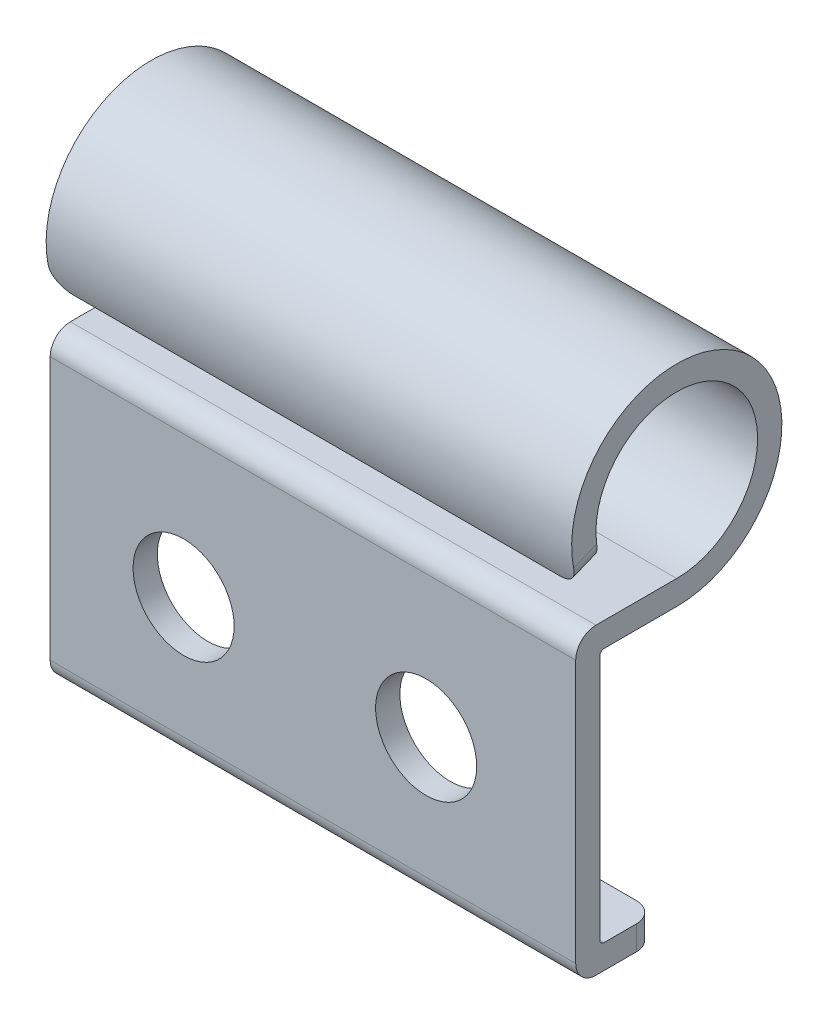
ISO-10303-21;
HEADER;
FILE_DESCRIPTION(('STEP AP214'),'2;1');
FILE_NAME('part.step','',(''),(''),'','','');
FILE_SCHEMA(('AUTOMOTIVE_DESIGN { 1 0 10303 214 1 1 1 1 }'));
ENDSEC;
DATA;
#1=APPLICATION_CONTEXT('core data for automotive mechanical design processes');
#2=APPLICATION_PROTOCOL_DEFINITION('international standard','automotive_design',2000,#1);
#3=PRODUCT_CONTEXT('',#1,'mechanical');
#4=PRODUCT('Part','Part','',(#3));
#5=PRODUCT_RELATED_PRODUCT_CATEGORY('part','',(#4));
#6=PRODUCT_DEFINITION_FORMATION('','',#4);
#7=PRODUCT_DEFINITION_CONTEXT('part definition',#1,'design');
#8=PRODUCT_DEFINITION('design','',#6,#7);
#9=PRODUCT_DEFINITION_SHAPE('','',#8);
#10=(LENGTH_UNIT() NAMED_UNIT(*) SI_UNIT(.MILLI.,.METRE.));
#11=(NAMED_UNIT(*) PLANE_ANGLE_UNIT() SI_UNIT($,.RADIAN.));
#12=(NAMED_UNIT(*) SI_UNIT($,.STERADIAN.) SOLID_ANGLE_UNIT());
#13=UNCERTAINTY_MEASURE_WITH_UNIT(LENGTH_MEASURE(1.E-05),#10,'distance_accuracy_value','');
#14=(GEOMETRIC_REPRESENTATION_CONTEXT(3) GLOBAL_UNCERTAINTY_ASSIGNED_CONTEXT((#13)) GLOBAL_UNIT_ASSIGNED_CONTEXT((#10,
#11,#12)) REPRESENTATION_CONTEXT('',''));
#15=CARTESIAN_POINT('',(0.,0.,0.));
#16=DIRECTION('',(0.,0.,1.));
#17=DIRECTION('',(1.,0.,0.));
#18=AXIS2_PLACEMENT_3D('',#15,#16,#17);
#19=CARTESIAN_POINT('',(13.,-9.,2.5));
#20=DIRECTION('',(0.,0.,1.));
#21=DIRECTION('',(1.,0.,0.));
#22=AXIS2_PLACEMENT_3D('',#19,#20,#21);
#23=PLANE('',#22);
#24=CARTESIAN_POINT('',(3.3,-6.,2.5));
#25=DIRECTION('',(0.,0.,-1.));
#26=DIRECTION('',(-1.,0.,0.));
#27=AXIS2_PLACEMENT_3D('',#24,#25,#26);
#28=CIRCLE('',#27,1.25);
#29=CARTESIAN_POINT('',(2.05,-6.,2.5));
#30=VERTEX_POINT('',#29);
#31=EDGE_CURVE('E209',#30,#30,#28,.T.);
#32=ORIENTED_EDGE('',*,*,#31,.T.);
#33=EDGE_LOOP('',(#32));
#34=FACE_BOUND('',#33,.T.);
#35=DIRECTION('',(0.,1.,0.));
#36=VECTOR('',#35,1.);
#37=CARTESIAN_POINT('',(0.,-9.,2.5));
#38=LINE('',#37,#36);
#39=CARTESIAN_POINT('',(0.,-9.,2.5));
#40=VERTEX_POINT('',#39);
#41=CARTESIAN_POINT('',(0.,-2.5,2.5));
#42=VERTEX_POINT('',#41);
#43=EDGE_CURVE('E216',#40,#42,#38,.T.);
#44=ORIENTED_EDGE('',*,*,#43,.F.);
#45=DIRECTION('',(-1.,0.,0.));
#46=VECTOR('',#45,1.);
#47=CARTESIAN_POINT('',(13.,-9.,2.5));
#48=LINE('',#47,#46);
#49=CARTESIAN_POINT('',(13.,-9.,2.5));
#50=VERTEX_POINT('',#49);
#51=EDGE_CURVE('E243',#50,#40,#48,.T.);
#52=ORIENTED_EDGE('',*,*,#51,.F.);
#53=DIRECTION('',(0.,1.,0.));
#54=VECTOR('',#53,1.);
#55=CARTESIAN_POINT('',(13.,-9.,2.5));
#56=LINE('',#55,#54);
#57=CARTESIAN_POINT('',(13.,-2.5,2.5));
#58=VERTEX_POINT('',#57);
#59=EDGE_CURVE('E187',#50,#58,#56,.T.);
#60=ORIENTED_EDGE('',*,*,#59,.T.);
#61=DIRECTION('',(-1.,0.,0.));
#62=VECTOR('',#61,1.);
#63=CARTESIAN_POINT('',(13.,-2.5,2.5));
#64=LINE('',#63,#62);
#65=EDGE_CURVE('E245',#58,#42,#64,.T.);
#66=ORIENTED_EDGE('',*,*,#65,.T.);
#67=EDGE_LOOP('',(#44,#52,#60,#66));
#68=FACE_BOUND('',#67,.T.);
#69=CARTESIAN_POINT('',(9.3,-6.,2.5));
#70=DIRECTION('',(0.,0.,-1.));
#71=DIRECTION('',(1.,0.,0.));
#72=AXIS2_PLACEMENT_3D('',#69,#70,#71);
#73=CIRCLE('',#72,1.25);
#74=CARTESIAN_POINT('',(10.55,-6.,2.5));
#75=VERTEX_POINT('',#74);
#76=EDGE_CURVE('E379',#75,#75,#73,.T.);
#77=ORIENTED_EDGE('',*,*,#76,.T.);
#78=EDGE_LOOP('',(#77));
#79=FACE_BOUND('',#78,.T.);
#80=ADVANCED_FACE('F34',(#34,#68,#79),#23,.T.);
#81=CARTESIAN_POINT('',(13.,-9.,1.9));
#82=DIRECTION('',(0.,0.,1.));
#83=DIRECTION('',(1.,0.,0.));
#84=AXIS2_PLACEMENT_3D('',#81,#82,#83);
#85=PLANE('',#84);
#86=CARTESIAN_POINT('',(3.3,-6.,1.9));
#87=DIRECTION('',(0.,0.,1.));
#88=DIRECTION('',(1.,0.,0.));
#89=AXIS2_PLACEMENT_3D('',#86,#87,#88);
#90=CIRCLE('',#89,1.25);
#91=CARTESIAN_POINT('',(4.55,-6.,1.9));
#92=VERTEX_POINT('',#91);
#93=EDGE_CURVE('E385',#92,#92,#90,.T.);
#94=ORIENTED_EDGE('',*,*,#93,.T.);
#95=EDGE_LOOP('',(#94));
#96=FACE_BOUND('',#95,.T.);
#97=DIRECTION('',(0.,1.,0.));
#98=VECTOR('',#97,1.);
#99=CARTESIAN_POINT('',(13.,-9.,1.9));
#100=LINE('',#99,#98);
#101=CARTESIAN_POINT('',(13.,-8.8,1.9));
#102=VERTEX_POINT('',#101);
#103=CARTESIAN_POINT('',(13.,-2.7,1.9));
#104=VERTEX_POINT('',#103);
#105=EDGE_CURVE('E201',#102,#104,#100,.T.);
#106=ORIENTED_EDGE('',*,*,#105,.F.);
#107=DIRECTION('',(-1.,0.,0.));
#108=VECTOR('',#107,1.);
#109=CARTESIAN_POINT('',(0.,-8.8,1.9));
#110=LINE('',#109,#108);
#111=CARTESIAN_POINT('',(0.,-8.8,1.9));
#112=VERTEX_POINT('',#111);
#113=EDGE_CURVE('E440',#102,#112,#110,.T.);
#114=ORIENTED_EDGE('',*,*,#113,.T.);
#115=DIRECTION('',(0.,1.,0.));
#116=VECTOR('',#115,1.);
#117=CARTESIAN_POINT('',(0.,-9.,1.9));
#118=LINE('',#117,#116);
#119=CARTESIAN_POINT('',(0.,-2.7,1.9));
#120=VERTEX_POINT('',#119);
#121=EDGE_CURVE('E227',#112,#120,#118,.T.);
#122=ORIENTED_EDGE('',*,*,#121,.T.);
#123=DIRECTION('',(-1.,0.,0.));
#124=VECTOR('',#123,1.);
#125=CARTESIAN_POINT('',(13.,-2.7,1.9));
#126=LINE('',#125,#124);
#127=EDGE_CURVE('E319',#120,#104,#126,.F.);
#128=ORIENTED_EDGE('',*,*,#127,.T.);
#129=EDGE_LOOP('',(#106,#114,#122,#128));
#130=FACE_BOUND('',#129,.T.);
#131=CARTESIAN_POINT('',(9.3,-6.,1.9));
#132=DIRECTION('',(0.,0.,1.));
#133=DIRECTION('',(1.,0.,0.));
#134=AXIS2_PLACEMENT_3D('',#131,#132,#133);
#135=CIRCLE('',#134,1.25);
#136=CARTESIAN_POINT('',(10.55,-6.,1.9));
#137=VERTEX_POINT('',#136);
#138=EDGE_CURVE('E382',#137,#137,#135,.T.);
#139=ORIENTED_EDGE('',*,*,#138,.T.);
#140=EDGE_LOOP('',(#139));
#141=FACE_BOUND('',#140,.T.);
#142=ADVANCED_FACE('F295',(#96,#130,#141),#85,.F.);
#143=CARTESIAN_POINT('',(13.,0.,0.));
#144=DIRECTION('',(-1.,0.,0.));
#145=DIRECTION('',(0.,0.,1.));
#146=AXIS2_PLACEMENT_3D('',#143,#144,#145);
#147=CYLINDRICAL_SURFACE('',#146,2.6);
#148=CARTESIAN_POINT('',(0.,0.,0.));
#149=DIRECTION('',(1.,0.,0.));
#150=DIRECTION('',(0.,0.,-1.));
#151=AXIS2_PLACEMENT_3D('',#148,#149,#150);
#152=CIRCLE('',#151,2.6);
#153=CARTESIAN_POINT('',(0.,-2.6,0.));
#154=VERTEX_POINT('',#153);
#155=CARTESIAN_POINT('',(0.,-0.504490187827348,2.55058613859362));
#156=VERTEX_POINT('',#155);
#157=EDGE_CURVE('E206',#154,#156,#152,.T.);
#158=ORIENTED_EDGE('',*,*,#157,.T.);
#159=CARTESIAN_POINT('',(0.,-0.504490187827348,2.55058613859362));
#160=CARTESIAN_POINT('',(-2.70065870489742E-05,-0.532036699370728,2.54515536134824));
#161=CARTESIAN_POINT('',(0.0022759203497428,-0.559491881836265,2.53924406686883));
#162=CARTESIAN_POINT('',(0.0114419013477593,-0.613454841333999,2.52674014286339));
#163=CARTESIAN_POINT('',(0.0183026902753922,-0.639963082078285,2.5201478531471));
#164=CARTESIAN_POINT('',(0.0364944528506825,-0.691323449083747,2.50654849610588));
#165=CARTESIAN_POINT('',(0.0478301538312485,-0.716173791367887,2.49954099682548));
#166=CARTESIAN_POINT('',(0.0746701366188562,-0.763488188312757,2.48549665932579));
#167=CARTESIAN_POINT('',(0.0901728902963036,-0.785953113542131,2.47845983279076));
#168=CARTESIAN_POINT('',(0.124751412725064,-0.827706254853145,2.4648288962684));
#169=CARTESIAN_POINT('',(0.143791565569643,-0.847022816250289,2.45823119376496));
#170=CARTESIAN_POINT('',(0.18501161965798,-0.882265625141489,2.44580403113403));
#171=CARTESIAN_POINT('',(0.2071923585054,-0.898190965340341,2.43997477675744));
#172=CARTESIAN_POINT('',(0.254161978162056,-0.926331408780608,2.42943156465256));
#173=CARTESIAN_POINT('',(0.278961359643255,-0.938530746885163,2.42472236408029));
#174=CARTESIAN_POINT('',(0.330390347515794,-0.958851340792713,2.41675894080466));
#175=CARTESIAN_POINT('',(0.357019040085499,-0.966974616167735,2.41350399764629));
#176=CARTESIAN_POINT('',(0.40314297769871,-0.977161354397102,2.40939335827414));
#177=CARTESIAN_POINT('',(0.422368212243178,-0.98031344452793,2.40811016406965));
#178=CARTESIAN_POINT('',(0.461059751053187,-0.98451801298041,2.40639265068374));
#179=CARTESIAN_POINT('',(0.480525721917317,-0.985573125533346,2.40595726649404));
#180=CARTESIAN_POINT('',(0.5,-0.985571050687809,2.40596128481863));
#181=B_SPLINE_CURVE_WITH_KNOTS('',3,(#159,#160,#161,#162,#163,#164,#165,#166,#167,#168,#169,
#170,#171,#172,#173,#174,#175,#176,#177,#178,#179,#180),.UNSPECIFIED.,.F.,.F.,(4,2,2,2,2,2,2,2,
2,2,4),(0.,0.0841368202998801,0.168231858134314,0.252415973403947,0.336569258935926,
0.419917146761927,0.50328730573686,0.587005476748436,0.670682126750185,0.729128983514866,
0.787502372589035),.UNSPECIFIED.);
#182=CARTESIAN_POINT('',(0.500000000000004,-0.985571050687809,2.40596128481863));
#183=VERTEX_POINT('',#182);
#184=EDGE_CURVE('E281',#156,#183,#181,.T.);
#185=ORIENTED_EDGE('',*,*,#184,.T.);
#186=DIRECTION('',(-1.,0.,0.));
#187=VECTOR('',#186,1.);
#188=CARTESIAN_POINT('',(13.,-0.985571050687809,2.40596128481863));
#189=LINE('',#188,#187);
#190=CARTESIAN_POINT('',(12.5,-0.985571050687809,2.40596128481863));
#191=VERTEX_POINT('',#190);
#192=EDGE_CURVE('E249',#191,#183,#189,.T.);
#193=ORIENTED_EDGE('',*,*,#192,.F.);
#194=CARTESIAN_POINT('',(12.5,-0.985571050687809,2.40596128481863));
#195=CARTESIAN_POINT('',(12.5281188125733,-0.985588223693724,2.4059402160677));
#196=CARTESIAN_POINT('',(12.5562305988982,-0.983377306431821,2.40685968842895));
#197=CARTESIAN_POINT('',(12.6116397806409,-0.974625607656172,2.41042425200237));
#198=CARTESIAN_POINT('',(12.6389377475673,-0.968087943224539,2.41306810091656));
#199=CARTESIAN_POINT('',(12.6919749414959,-0.950804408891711,2.4199280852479));
#200=CARTESIAN_POINT('',(12.7177133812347,-0.940056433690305,2.42414500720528));
#201=CARTESIAN_POINT('',(12.7668811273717,-0.914600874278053,2.43386346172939));
#202=CARTESIAN_POINT('',(12.7903108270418,-0.899893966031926,2.43936477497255));
#203=CARTESIAN_POINT('',(12.834161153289,-0.866887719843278,2.4512877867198));
#204=CARTESIAN_POINT('',(12.8545863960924,-0.84859399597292,2.4577080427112));
#205=CARTESIAN_POINT('',(12.891887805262,-0.808848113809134,2.47107331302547));
#206=CARTESIAN_POINT('',(12.9087638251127,-0.787395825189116,2.4780183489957));
#207=CARTESIAN_POINT('',(12.9383951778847,-0.742040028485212,2.49197420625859));
#208=CARTESIAN_POINT('',(12.9511757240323,-0.71815276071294,2.49898434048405));
#209=CARTESIAN_POINT('',(12.9724234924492,-0.668460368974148,2.51273233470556));
#210=CARTESIAN_POINT('',(12.9808921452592,-0.642655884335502,2.51947028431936));
#211=CARTESIAN_POINT('',(12.9914119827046,-0.59802712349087,2.53035897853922));
#212=CARTESIAN_POINT('',(12.9946373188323,-0.57950790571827,2.53466615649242));
#213=CARTESIAN_POINT('',(12.9989314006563,-0.54217155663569,2.54291546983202));
#214=CARTESIAN_POINT('',(13.0000035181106,-0.523354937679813,2.54685816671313));
#215=CARTESIAN_POINT('',(13.,-0.504490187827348,2.55058613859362));
#216=B_SPLINE_CURVE_WITH_KNOTS('',3,(#194,#195,#196,#197,#198,#199,#200,#201,#202,#203,#204,
#205,#206,#207,#208,#209,#210,#211,#212,#213,#214,#215),.UNSPECIFIED.,.F.,.F.,(4,2,2,2,2,2,2,2,
2,2,4),(0.,0.0842446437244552,0.168428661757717,0.252654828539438,0.336866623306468,
0.420947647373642,0.505032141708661,0.588588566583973,0.672117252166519,0.729853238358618,
0.787498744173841),.UNSPECIFIED.);
#217=CARTESIAN_POINT('',(13.,-0.504490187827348,2.55058613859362));
#218=VERTEX_POINT('',#217);
#219=EDGE_CURVE('E274',#191,#218,#216,.T.);
#220=ORIENTED_EDGE('',*,*,#219,.T.);
#221=CARTESIAN_POINT('',(13.,0.,0.));
#222=DIRECTION('',(1.,0.,0.));
#223=DIRECTION('',(0.,0.,-1.));
#224=AXIS2_PLACEMENT_3D('',#221,#222,#223);
#225=CIRCLE('',#224,2.6);
#226=CARTESIAN_POINT('',(13.,-2.6,0.));
#227=VERTEX_POINT('',#226);
#228=EDGE_CURVE('E182',#227,#218,#225,.T.);
#229=ORIENTED_EDGE('',*,*,#228,.F.);
#230=DIRECTION('',(-1.,0.,0.));
#231=VECTOR('',#230,1.);
#232=CARTESIAN_POINT('',(13.,-2.6,0.));
#233=LINE('',#232,#231);
#234=EDGE_CURVE('E205',#227,#154,#233,.T.);
#235=ORIENTED_EDGE('',*,*,#234,.T.);
#236=EDGE_LOOP('',(#158,#185,#193,#220,#229,#235));
#237=FACE_BOUND('',#236,.T.);
#238=ADVANCED_FACE('F289',(#237),#147,.T.);
#239=CARTESIAN_POINT('',(13.,-0.758131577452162,1.85073944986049));
#240=DIRECTION('',(0.,-0.925369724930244,-0.379065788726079));
#241=DIRECTION('',(0.,0.379065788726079,-0.925369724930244));
#242=AXIS2_PLACEMENT_3D('',#239,#240,#241);
#243=PLANE('',#242);
#244=ORIENTED_EDGE('',*,*,#192,.T.);
#245=DIRECTION('',(0.,-0.379065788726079,0.925369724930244));
#246=VECTOR('',#245,1.);
#247=CARTESIAN_POINT('',(0.5,-0.758131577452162,1.85073944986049));
#248=LINE('',#247,#246);
#249=CARTESIAN_POINT('',(0.500000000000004,-0.758131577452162,1.85073944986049));
#250=VERTEX_POINT('',#249);
#251=EDGE_CURVE('E398',#183,#250,#248,.F.);
#252=ORIENTED_EDGE('',*,*,#251,.T.);
#253=DIRECTION('',(-1.,0.,0.));
#254=VECTOR('',#253,1.);
#255=CARTESIAN_POINT('',(13.,-0.758131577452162,1.85073944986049));
#256=LINE('',#255,#254);
#257=CARTESIAN_POINT('',(12.5,-0.758131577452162,1.85073944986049));
#258=VERTEX_POINT('',#257);
#259=EDGE_CURVE('E170',#258,#250,#256,.T.);
#260=ORIENTED_EDGE('',*,*,#259,.F.);
#261=DIRECTION('',(0.,-0.379065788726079,0.925369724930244));
#262=VECTOR('',#261,1.);
#263=CARTESIAN_POINT('',(12.5,-0.758131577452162,1.85073944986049));
#264=LINE('',#263,#262);
#265=EDGE_CURVE('E396',#258,#191,#264,.T.);
#266=ORIENTED_EDGE('',*,*,#265,.T.);
#267=EDGE_LOOP('',(#244,#252,#260,#266));
#268=FACE_BOUND('',#267,.T.);
#269=ADVANCED_FACE('F294',(#268),#243,.T.);
#270=CARTESIAN_POINT('',(13.,0.,0.));
#271=DIRECTION('',(-1.,0.,0.));
#272=DIRECTION('',(0.,0.,1.));
#273=AXIS2_PLACEMENT_3D('',#270,#271,#272);
#274=CYLINDRICAL_SURFACE('',#273,2.);
#275=ORIENTED_EDGE('',*,*,#259,.T.);
#276=CARTESIAN_POINT('',(0.5,-0.758131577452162,1.85073944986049));
#277=CARTESIAN_POINT('',(0.47188832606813,-0.758147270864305,1.85071479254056));
#278=CARTESIAN_POINT('',(0.443783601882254,-0.755938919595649,1.85163733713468));
#279=CARTESIAN_POINT('',(0.388386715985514,-0.747189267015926,1.85519495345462));
#280=CARTESIAN_POINT('',(0.361094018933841,-0.740650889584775,1.85782886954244));
#281=CARTESIAN_POINT('',(0.30806617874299,-0.723351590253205,1.86462955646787));
#282=CARTESIAN_POINT('',(0.282331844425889,-0.712588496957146,1.86879711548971));
#283=CARTESIAN_POINT('',(0.233172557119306,-0.687069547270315,1.87832943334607));
#284=CARTESIAN_POINT('',(0.209747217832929,-0.672314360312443,1.88369399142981));
#285=CARTESIAN_POINT('',(0.165932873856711,-0.63917826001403,1.89519302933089));
#286=CARTESIAN_POINT('',(0.145536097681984,-0.620806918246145,1.9013254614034));
#287=CARTESIAN_POINT('',(0.108293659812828,-0.580853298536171,1.91390883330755));
#288=CARTESIAN_POINT('',(0.0914477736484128,-0.559271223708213,1.92035975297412));
#289=CARTESIAN_POINT('',(0.0619384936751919,-0.513706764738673,1.93304371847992));
#290=CARTESIAN_POINT('',(0.0492324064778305,-0.489752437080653,1.93927835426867));
#291=CARTESIAN_POINT('',(0.0280730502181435,-0.439903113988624,1.95118955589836));
#292=CARTESIAN_POINT('',(0.019619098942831,-0.414008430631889,1.95686621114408));
#293=CARTESIAN_POINT('',(0.00889463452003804,-0.368580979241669,1.96583855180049));
#294=CARTESIAN_POINT('',(0.00554886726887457,-0.34933619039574,1.96935194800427));
#295=CARTESIAN_POINT('',(0.00110116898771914,-0.310532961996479,1.9758442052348));
#296=CARTESIAN_POINT('',(-4.48377917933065E-06,-0.290975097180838,1.97882394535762));
#297=CARTESIAN_POINT('',(0.,-0.271372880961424,1.98150366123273));
#298=B_SPLINE_CURVE_WITH_KNOTS('',3,(#276,#277,#278,#279,#280,#281,#282,#283,#284,#285,#286,
#287,#288,#289,#290,#291,#292,#293,#294,#295,#296,#297),.UNSPECIFIED.,.F.,.F.,(4,2,2,2,2,2,2,2,
2,2,4),(0.,0.0842234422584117,0.168390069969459,0.252600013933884,0.336795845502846,
0.420771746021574,0.504742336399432,0.5878173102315,0.670878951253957,0.730289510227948,
0.78960128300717),.UNSPECIFIED.);
#299=CARTESIAN_POINT('',(0.,-0.271372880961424,1.98150366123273));
#300=VERTEX_POINT('',#299);
#301=EDGE_CURVE('E313',#250,#300,#298,.T.);
#302=ORIENTED_EDGE('',*,*,#301,.T.);
#303=CARTESIAN_POINT('',(0.,0.,0.));
#304=DIRECTION('',(1.,0.,0.));
#305=DIRECTION('',(0.,0.,-1.));
#306=AXIS2_PLACEMENT_3D('',#303,#304,#305);
#307=CIRCLE('',#306,2.);
#308=CARTESIAN_POINT('',(0.,-2.,0.));
#309=VERTEX_POINT('',#308);
#310=EDGE_CURVE('E165',#309,#300,#307,.T.);
#311=ORIENTED_EDGE('',*,*,#310,.F.);
#312=DIRECTION('',(-1.,0.,0.));
#313=VECTOR('',#312,1.);
#314=CARTESIAN_POINT('',(13.,-2.,0.));
#315=LINE('',#314,#313);
#316=CARTESIAN_POINT('',(13.,-2.,0.));
#317=VERTEX_POINT('',#316);
#318=EDGE_CURVE('E158',#317,#309,#315,.T.);
#319=ORIENTED_EDGE('',*,*,#318,.F.);
#320=CARTESIAN_POINT('',(13.,0.,0.));
#321=DIRECTION('',(1.,0.,0.));
#322=DIRECTION('',(0.,0.,-1.));
#323=AXIS2_PLACEMENT_3D('',#320,#321,#322);
#324=CIRCLE('',#323,2.);
#325=CARTESIAN_POINT('',(13.,-0.271372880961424,1.98150366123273));
#326=VERTEX_POINT('',#325);
#327=EDGE_CURVE('E162',#317,#326,#324,.T.);
#328=ORIENTED_EDGE('',*,*,#327,.T.);
#329=CARTESIAN_POINT('',(13.,-0.271372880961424,1.98150366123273));
#330=CARTESIAN_POINT('',(13.0000288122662,-0.299157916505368,1.97772108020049));
#331=CARTESIAN_POINT('',(12.997790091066,-0.326867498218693,1.97330895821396));
#332=CARTESIAN_POINT('',(12.9888252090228,-0.381360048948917,1.96349352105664));
#333=CARTESIAN_POINT('',(12.9821003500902,-0.408143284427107,1.95809049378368));
#334=CARTESIAN_POINT('',(12.9641978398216,-0.460061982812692,1.94655028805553));
#335=CARTESIAN_POINT('',(12.9530137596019,-0.485195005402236,1.94041205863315));
#336=CARTESIAN_POINT('',(12.9264679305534,-0.533042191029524,1.92781660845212));
#337=CARTESIAN_POINT('',(12.9111082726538,-0.555757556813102,1.92135954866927));
#338=CARTESIAN_POINT('',(12.8769061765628,-0.597830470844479,1.90868415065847));
#339=CARTESIAN_POINT('',(12.8581234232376,-0.617235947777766,1.90246364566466));
#340=CARTESIAN_POINT('',(12.8174344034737,-0.652665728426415,1.89060236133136));
#341=CARTESIAN_POINT('',(12.7955271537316,-0.668688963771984,1.88496176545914));
#342=CARTESIAN_POINT('',(12.7490535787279,-0.697086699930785,1.87464683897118));
#343=CARTESIAN_POINT('',(12.7244706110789,-0.709436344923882,1.86997915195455));
#344=CARTESIAN_POINT('',(12.6734564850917,-0.730083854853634,1.86201516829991));
#345=CARTESIAN_POINT('',(12.6470261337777,-0.738383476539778,1.85871827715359));
#346=CARTESIAN_POINT('',(12.600421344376,-0.749083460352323,1.85442661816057));
#347=CARTESIAN_POINT('',(12.5805026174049,-0.752474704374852,1.8530494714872));
#348=CARTESIAN_POINT('',(12.5403917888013,-0.756998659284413,1.85120351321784));
#349=CARTESIAN_POINT('',(12.5202000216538,-0.758133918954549,1.85073367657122));
#350=CARTESIAN_POINT('',(12.5,-0.758131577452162,1.85073944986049));
#351=B_SPLINE_CURVE_WITH_KNOTS('',3,(#329,#330,#331,#332,#333,#334,#335,#336,#337,#338,#339,
#340,#341,#342,#343,#344,#345,#346,#347,#348,#349,#350),.UNSPECIFIED.,.F.,.F.,(4,2,2,2,2,2,2,2,
2,2,4),(0.,0.0840428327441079,0.168061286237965,0.252201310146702,0.33629927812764,
0.419051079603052,0.50182898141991,0.585154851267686,0.668444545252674,0.72906001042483,
0.789606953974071),.UNSPECIFIED.);
#352=EDGE_CURVE('E320',#326,#258,#351,.T.);
#353=ORIENTED_EDGE('',*,*,#352,.T.);
#354=EDGE_LOOP('',(#275,#302,#311,#319,#328,#353));
#355=FACE_BOUND('',#354,.T.);
#356=ADVANCED_FACE('F161',(#355),#274,.F.);
#357=CARTESIAN_POINT('',(13.,-2.,2.));
#358=DIRECTION('',(0.,1.,0.));
#359=DIRECTION('',(0.,0.,1.));
#360=AXIS2_PLACEMENT_3D('',#357,#358,#359);
#361=PLANE('',#360);
#362=DIRECTION('',(0.,0.,-1.));
#363=VECTOR('',#362,1.);
#364=CARTESIAN_POINT('',(0.,-2.,2.));
#365=LINE('',#364,#363);
#366=CARTESIAN_POINT('',(0.,-2.,2.));
#367=VERTEX_POINT('',#366);
#368=EDGE_CURVE('E211',#367,#309,#365,.T.);
#369=ORIENTED_EDGE('',*,*,#368,.F.);
#370=DIRECTION('',(-1.,0.,0.));
#371=VECTOR('',#370,1.);
#372=CARTESIAN_POINT('',(13.,-2.,2.));
#373=LINE('',#372,#371);
#374=CARTESIAN_POINT('',(13.,-2.,2.));
#375=VERTEX_POINT('',#374);
#376=EDGE_CURVE('E171',#375,#367,#373,.T.);
#377=ORIENTED_EDGE('',*,*,#376,.F.);
#378=DIRECTION('',(0.,0.,-1.));
#379=VECTOR('',#378,1.);
#380=CARTESIAN_POINT('',(13.,-2.,2.));
#381=LINE('',#380,#379);
#382=EDGE_CURVE('E177',#375,#317,#381,.T.);
#383=ORIENTED_EDGE('',*,*,#382,.T.);
#384=ORIENTED_EDGE('',*,*,#318,.T.);
#385=EDGE_LOOP('',(#369,#377,#383,#384));
#386=FACE_BOUND('',#385,.T.);
#387=ADVANCED_FACE('F184',(#386),#361,.T.);
#388=CARTESIAN_POINT('',(13.,-2.5,2.));
#389=DIRECTION('',(-1.,0.,0.));
#390=DIRECTION('',(0.,0.,1.));
#391=AXIS2_PLACEMENT_3D('',#388,#389,#390);
#392=CYLINDRICAL_SURFACE('',#391,0.5);
#393=CARTESIAN_POINT('',(0.,-2.5,2.));
#394=DIRECTION('',(-1.,0.,0.));
#395=DIRECTION('',(0.,0.,1.));
#396=AXIS2_PLACEMENT_3D('',#393,#394,#395);
#397=CIRCLE('',#396,0.5);
#398=EDGE_CURVE('E213',#42,#367,#397,.T.);
#399=ORIENTED_EDGE('',*,*,#398,.F.);
#400=ORIENTED_EDGE('',*,*,#65,.F.);
#401=CARTESIAN_POINT('',(13.,-2.5,2.));
#402=DIRECTION('',(-1.,0.,0.));
#403=DIRECTION('',(0.,0.,1.));
#404=AXIS2_PLACEMENT_3D('',#401,#402,#403);
#405=CIRCLE('',#404,0.5);
#406=EDGE_CURVE('E185',#58,#375,#405,.T.);
#407=ORIENTED_EDGE('',*,*,#406,.T.);
#408=ORIENTED_EDGE('',*,*,#376,.T.);
#409=EDGE_LOOP('',(#399,#400,#407,#408));
#410=FACE_BOUND('',#409,.T.);
#411=ADVANCED_FACE('F332',(#410),#392,.T.);
#412=CARTESIAN_POINT('',(13.,-9.,2.));
#413=DIRECTION('',(-1.,0.,0.));
#414=DIRECTION('',(0.,0.,1.));
#415=AXIS2_PLACEMENT_3D('',#412,#413,#414);
#416=CYLINDRICAL_SURFACE('',#415,0.500000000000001);
#417=CARTESIAN_POINT('',(0.,-9.,2.));
#418=DIRECTION('',(-1.,0.,0.));
#419=DIRECTION('',(0.,0.,1.));
#420=AXIS2_PLACEMENT_3D('',#417,#418,#419);
#421=CIRCLE('',#420,0.500000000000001);
#422=CARTESIAN_POINT('',(0.,-9.5,2.));
#423=VERTEX_POINT('',#422);
#424=EDGE_CURVE('E219',#423,#40,#421,.T.);
#425=ORIENTED_EDGE('',*,*,#424,.F.);
#426=DIRECTION('',(-1.,0.,0.));
#427=VECTOR('',#426,1.);
#428=CARTESIAN_POINT('',(13.,-9.5,2.));
#429=LINE('',#428,#427);
#430=CARTESIAN_POINT('',(13.,-9.5,2.));
#431=VERTEX_POINT('',#430);
#432=EDGE_CURVE('E240',#431,#423,#429,.T.);
#433=ORIENTED_EDGE('',*,*,#432,.F.);
#434=CARTESIAN_POINT('',(13.,-9.,2.));
#435=DIRECTION('',(-1.,0.,0.));
#436=DIRECTION('',(0.,0.,1.));
#437=AXIS2_PLACEMENT_3D('',#434,#435,#436);
#438=CIRCLE('',#437,0.500000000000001);
#439=EDGE_CURVE('E193',#431,#50,#438,.T.);
#440=ORIENTED_EDGE('',*,*,#439,.T.);
#441=ORIENTED_EDGE('',*,*,#51,.T.);
#442=EDGE_LOOP('',(#425,#433,#440,#441));
#443=FACE_BOUND('',#442,.T.);
#444=ADVANCED_FACE('F335',(#443),#416,.T.);
#445=CARTESIAN_POINT('',(13.,-9.5,0.5));
#446=DIRECTION('',(0.,-1.,0.));
#447=DIRECTION('',(0.,0.,-1.));
#448=AXIS2_PLACEMENT_3D('',#445,#446,#447);
#449=PLANE('',#448);
#450=DIRECTION('',(0.,0.,1.));
#451=VECTOR('',#450,1.);
#452=CARTESIAN_POINT('',(0.,-9.5,0.5));
#453=LINE('',#452,#451);
#454=CARTESIAN_POINT('',(0.,-9.5,1.));
#455=VERTEX_POINT('',#454);
#456=EDGE_CURVE('E222',#455,#423,#453,.T.);
#457=ORIENTED_EDGE('',*,*,#456,.F.);
#458=CARTESIAN_POINT('',(0.5,-9.5,1.));
#459=DIRECTION('',(0.,-1.,0.));
#460=DIRECTION('',(0.,0.,-1.));
#461=AXIS2_PLACEMENT_3D('',#458,#459,#460);
#462=CIRCLE('',#461,0.5);
#463=CARTESIAN_POINT('',(0.500000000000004,-9.5,0.5));
#464=VERTEX_POINT('',#463);
#465=EDGE_CURVE('E260',#455,#464,#462,.T.);
#466=ORIENTED_EDGE('',*,*,#465,.T.);
#467=DIRECTION('',(-1.,0.,0.));
#468=VECTOR('',#467,1.);
#469=CARTESIAN_POINT('',(13.,-9.5,0.5));
#470=LINE('',#469,#468);
#471=CARTESIAN_POINT('',(12.5,-9.5,0.5));
#472=VERTEX_POINT('',#471);
#473=EDGE_CURVE('E237',#472,#464,#470,.T.);
#474=ORIENTED_EDGE('',*,*,#473,.F.);
#475=CARTESIAN_POINT('',(12.5,-9.5,1.));
#476=DIRECTION('',(0.,-1.,0.));
#477=DIRECTION('',(0.,0.,-1.));
#478=AXIS2_PLACEMENT_3D('',#475,#476,#477);
#479=CIRCLE('',#478,0.5);
#480=CARTESIAN_POINT('',(13.,-9.5,1.));
#481=VERTEX_POINT('',#480);
#482=EDGE_CURVE('E258',#472,#481,#479,.T.);
#483=ORIENTED_EDGE('',*,*,#482,.T.);
#484=DIRECTION('',(0.,0.,1.));
#485=VECTOR('',#484,1.);
#486=CARTESIAN_POINT('',(13.,-9.5,0.5));
#487=LINE('',#486,#485);
#488=EDGE_CURVE('E196',#481,#431,#487,.T.);
#489=ORIENTED_EDGE('',*,*,#488,.T.);
#490=ORIENTED_EDGE('',*,*,#432,.T.);
#491=EDGE_LOOP('',(#457,#466,#474,#483,#489,#490));
#492=FACE_BOUND('',#491,.T.);
#493=ADVANCED_FACE('F342',(#492),#449,.T.);
#494=CARTESIAN_POINT('',(13.,-8.9,0.500000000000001));
#495=DIRECTION('',(0.,0.,-1.));
#496=DIRECTION('',(0.,1.,0.));
#497=AXIS2_PLACEMENT_3D('',#494,#495,#496);
#498=PLANE('',#497);
#499=ORIENTED_EDGE('',*,*,#473,.T.);
#500=DIRECTION('',(0.,-1.,0.));
#501=VECTOR('',#500,1.);
#502=CARTESIAN_POINT('',(0.5,-8.9,0.500000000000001));
#503=LINE('',#502,#501);
#504=CARTESIAN_POINT('',(0.500000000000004,-8.9,0.500000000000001));
#505=VERTEX_POINT('',#504);
#506=EDGE_CURVE('E265',#464,#505,#503,.F.);
#507=ORIENTED_EDGE('',*,*,#506,.T.);
#508=DIRECTION('',(-1.,0.,0.));
#509=VECTOR('',#508,1.);
#510=CARTESIAN_POINT('',(13.,-8.9,0.500000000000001));
#511=LINE('',#510,#509);
#512=CARTESIAN_POINT('',(12.5,-8.9,0.500000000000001));
#513=VERTEX_POINT('',#512);
#514=EDGE_CURVE('E234',#513,#505,#511,.T.);
#515=ORIENTED_EDGE('',*,*,#514,.F.);
#516=DIRECTION('',(0.,-1.,0.));
#517=VECTOR('',#516,1.);
#518=CARTESIAN_POINT('',(12.5,-8.9,0.500000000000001));
#519=LINE('',#518,#517);
#520=EDGE_CURVE('E262',#513,#472,#519,.T.);
#521=ORIENTED_EDGE('',*,*,#520,.T.);
#522=EDGE_LOOP('',(#499,#507,#515,#521));
#523=FACE_BOUND('',#522,.T.);
#524=ADVANCED_FACE('F346',(#523),#498,.T.);
#525=CARTESIAN_POINT('',(13.,-8.9,0.500000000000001));
#526=DIRECTION('',(0.,-1.,0.));
#527=DIRECTION('',(0.,0.,-1.));
#528=AXIS2_PLACEMENT_3D('',#525,#526,#527);
#529=PLANE('',#528);
#530=DIRECTION('',(0.,0.,1.));
#531=VECTOR('',#530,1.);
#532=CARTESIAN_POINT('',(0.,-8.9,0.500000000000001));
#533=LINE('',#532,#531);
#534=CARTESIAN_POINT('',(0.,-8.9,1.));
#535=VERTEX_POINT('',#534);
#536=CARTESIAN_POINT('',(0.,-8.9,1.8));
#537=VERTEX_POINT('',#536);
#538=EDGE_CURVE('E224',#535,#537,#533,.T.);
#539=ORIENTED_EDGE('',*,*,#538,.T.);
#540=DIRECTION('',(-1.,0.,0.));
#541=VECTOR('',#540,1.);
#542=CARTESIAN_POINT('',(13.,-8.9,1.8));
#543=LINE('',#542,#541);
#544=CARTESIAN_POINT('',(13.,-8.9,1.8));
#545=VERTEX_POINT('',#544);
#546=EDGE_CURVE('E434',#537,#545,#543,.F.);
#547=ORIENTED_EDGE('',*,*,#546,.T.);
#548=DIRECTION('',(0.,0.,1.));
#549=VECTOR('',#548,1.);
#550=CARTESIAN_POINT('',(13.,-8.9,0.500000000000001));
#551=LINE('',#550,#549);
#552=CARTESIAN_POINT('',(13.,-8.9,1.));
#553=VERTEX_POINT('',#552);
#554=EDGE_CURVE('E198',#553,#545,#551,.T.);
#555=ORIENTED_EDGE('',*,*,#554,.F.);
#556=CARTESIAN_POINT('',(12.5,-8.9,1.));
#557=DIRECTION('',(0.,-1.,0.));
#558=DIRECTION('',(0.,0.,-1.));
#559=AXIS2_PLACEMENT_3D('',#556,#557,#558);
#560=CIRCLE('',#559,0.5);
#561=EDGE_CURVE('E267',#553,#513,#560,.F.);
#562=ORIENTED_EDGE('',*,*,#561,.T.);
#563=ORIENTED_EDGE('',*,*,#514,.T.);
#564=CARTESIAN_POINT('',(0.5,-8.9,1.));
#565=DIRECTION('',(0.,-1.,0.));
#566=DIRECTION('',(0.,0.,-1.));
#567=AXIS2_PLACEMENT_3D('',#564,#565,#566);
#568=CIRCLE('',#567,0.5);
#569=EDGE_CURVE('E269',#505,#535,#568,.F.);
#570=ORIENTED_EDGE('',*,*,#569,.T.);
#571=EDGE_LOOP('',(#539,#547,#555,#562,#563,#570));
#572=FACE_BOUND('',#571,.T.);
#573=ADVANCED_FACE('F350',(#572),#529,.F.);
#574=CARTESIAN_POINT('',(13.,-2.6,2.));
#575=DIRECTION('',(0.,1.,0.));
#576=DIRECTION('',(0.,0.,1.));
#577=AXIS2_PLACEMENT_3D('',#574,#575,#576);
#578=PLANE('',#577);
#579=DIRECTION('',(0.,0.,-1.));
#580=VECTOR('',#579,1.);
#581=CARTESIAN_POINT('',(13.,-2.6,2.));
#582=LINE('',#581,#580);
#583=CARTESIAN_POINT('',(13.,-2.6,1.8));
#584=VERTEX_POINT('',#583);
#585=EDGE_CURVE('E203',#584,#227,#582,.T.);
#586=ORIENTED_EDGE('',*,*,#585,.F.);
#587=DIRECTION('',(-1.,0.,0.));
#588=VECTOR('',#587,1.);
#589=CARTESIAN_POINT('',(0.,-2.6,1.8));
#590=LINE('',#589,#588);
#591=CARTESIAN_POINT('',(0.,-2.6,1.8));
#592=VERTEX_POINT('',#591);
#593=EDGE_CURVE('E431',#584,#592,#590,.T.);
#594=ORIENTED_EDGE('',*,*,#593,.T.);
#595=DIRECTION('',(0.,0.,-1.));
#596=VECTOR('',#595,1.);
#597=CARTESIAN_POINT('',(0.,-2.6,2.));
#598=LINE('',#597,#596);
#599=EDGE_CURVE('E230',#592,#154,#598,.T.);
#600=ORIENTED_EDGE('',*,*,#599,.T.);
#601=ORIENTED_EDGE('',*,*,#234,.F.);
#602=EDGE_LOOP('',(#586,#594,#600,#601));
#603=FACE_BOUND('',#602,.T.);
#604=ADVANCED_FACE('F354',(#603),#578,.F.);
#605=CARTESIAN_POINT('',(13.,0.,0.));
#606=DIRECTION('',(1.,0.,0.));
#607=DIRECTION('',(0.,0.,-1.));
#608=AXIS2_PLACEMENT_3D('',#605,#606,#607);
#609=PLANE('',#608);
#610=ORIENTED_EDGE('',*,*,#488,.F.);
#611=DIRECTION('',(0.,-1.,0.));
#612=VECTOR('',#611,1.);
#613=CARTESIAN_POINT('',(13.,0.,1.00000000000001));
#614=LINE('',#613,#612);
#615=EDGE_CURVE('E272',#481,#553,#614,.F.);
#616=ORIENTED_EDGE('',*,*,#615,.T.);
#617=ORIENTED_EDGE('',*,*,#554,.T.);
#618=CARTESIAN_POINT('',(13.,-8.8,1.8));
#619=DIRECTION('',(1.,0.,0.));
#620=DIRECTION('',(0.,0.,-1.));
#621=AXIS2_PLACEMENT_3D('',#618,#619,#620);
#622=CIRCLE('',#621,0.1);
#623=EDGE_CURVE('E430',#545,#102,#622,.F.);
#624=ORIENTED_EDGE('',*,*,#623,.T.);
#625=ORIENTED_EDGE('',*,*,#105,.T.);
#626=CARTESIAN_POINT('',(13.,-2.7,1.8));
#627=DIRECTION('',(1.,0.,0.));
#628=DIRECTION('',(0.,0.,-1.));
#629=AXIS2_PLACEMENT_3D('',#626,#627,#628);
#630=CIRCLE('',#629,0.1);
#631=EDGE_CURVE('E11',#104,#584,#630,.F.);
#632=ORIENTED_EDGE('',*,*,#631,.T.);
#633=ORIENTED_EDGE('',*,*,#585,.T.);
#634=ORIENTED_EDGE('',*,*,#228,.T.);
#635=DIRECTION('',(0.,-0.379065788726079,0.925369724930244));
#636=VECTOR('',#635,1.);
#637=CARTESIAN_POINT('',(13.,0.462684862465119,0.189532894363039));
#638=LINE('',#637,#636);
#639=EDGE_CURVE('E181',#218,#326,#638,.F.);
#640=ORIENTED_EDGE('',*,*,#639,.T.);
#641=ORIENTED_EDGE('',*,*,#327,.F.);
#642=ORIENTED_EDGE('',*,*,#382,.F.);
#643=ORIENTED_EDGE('',*,*,#406,.F.);
#644=ORIENTED_EDGE('',*,*,#59,.F.);
#645=ORIENTED_EDGE('',*,*,#439,.F.);
#646=EDGE_LOOP('',(#610,#616,#617,#624,#625,#632,#633,#634,#640,#641,#642,#643,#644,#645));
#647=FACE_BOUND('',#646,.T.);
#648=ADVANCED_FACE('F175',(#647),#609,.T.);
#649=CARTESIAN_POINT('',(0.,0.,0.));
#650=DIRECTION('',(1.,0.,0.));
#651=DIRECTION('',(0.,0.,-1.));
#652=AXIS2_PLACEMENT_3D('',#649,#650,#651);
#653=PLANE('',#652);
#654=ORIENTED_EDGE('',*,*,#538,.F.);
#655=DIRECTION('',(0.,-1.,0.));
#656=VECTOR('',#655,1.);
#657=CARTESIAN_POINT('',(0.,-9.5,1.));
#658=LINE('',#657,#656);
#659=EDGE_CURVE('E255',#535,#455,#658,.T.);
#660=ORIENTED_EDGE('',*,*,#659,.T.);
#661=ORIENTED_EDGE('',*,*,#456,.T.);
#662=ORIENTED_EDGE('',*,*,#424,.T.);
#663=ORIENTED_EDGE('',*,*,#43,.T.);
#664=ORIENTED_EDGE('',*,*,#398,.T.);
#665=ORIENTED_EDGE('',*,*,#368,.T.);
#666=ORIENTED_EDGE('',*,*,#310,.T.);
#667=DIRECTION('',(0.,-0.379065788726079,0.925369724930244));
#668=VECTOR('',#667,1.);
#669=CARTESIAN_POINT('',(0.,-0.522886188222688,2.59549417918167));
#670=LINE('',#669,#668);
#671=EDGE_CURVE('E252',#300,#156,#670,.T.);
#672=ORIENTED_EDGE('',*,*,#671,.T.);
#673=ORIENTED_EDGE('',*,*,#157,.F.);
#674=ORIENTED_EDGE('',*,*,#599,.F.);
#675=CARTESIAN_POINT('',(0.,-2.7,1.8));
#676=DIRECTION('',(1.,0.,0.));
#677=DIRECTION('',(0.,0.,-1.));
#678=AXIS2_PLACEMENT_3D('',#675,#676,#677);
#679=CIRCLE('',#678,0.1);
#680=EDGE_CURVE('E42',#592,#120,#679,.T.);
#681=ORIENTED_EDGE('',*,*,#680,.T.);
#682=ORIENTED_EDGE('',*,*,#121,.F.);
#683=CARTESIAN_POINT('',(0.,-8.8,1.8));
#684=DIRECTION('',(1.,0.,0.));
#685=DIRECTION('',(0.,0.,-1.));
#686=AXIS2_PLACEMENT_3D('',#683,#684,#685);
#687=CIRCLE('',#686,0.1);
#688=EDGE_CURVE('E426',#112,#537,#687,.T.);
#689=ORIENTED_EDGE('',*,*,#688,.T.);
#690=EDGE_LOOP('',(#654,#660,#661,#662,#663,#664,#665,#666,#672,#673,#674,#681,#682,#689));
#691=FACE_BOUND('',#690,.T.);
#692=ADVANCED_FACE('F362',(#691),#653,.F.);
#693=CARTESIAN_POINT('',(3.3,-6.,-2.601));
#694=DIRECTION('',(0.,0.,1.));
#695=DIRECTION('',(1.,0.,0.));
#696=AXIS2_PLACEMENT_3D('',#693,#694,#695);
#697=CYLINDRICAL_SURFACE('',#696,1.25);
#698=ORIENTED_EDGE('',*,*,#31,.F.);
#699=EDGE_LOOP('',(#698));
#700=FACE_BOUND('',#699,.T.);
#701=ORIENTED_EDGE('',*,*,#93,.F.);
#702=EDGE_LOOP('',(#701));
#703=FACE_BOUND('',#702,.T.);
#704=ADVANCED_FACE('F365',(#700,#703),#697,.F.);
#705=CARTESIAN_POINT('',(9.3,-6.,-2.601));
#706=DIRECTION('',(0.,0.,1.));
#707=DIRECTION('',(1.,0.,0.));
#708=AXIS2_PLACEMENT_3D('',#705,#706,#707);
#709=CYLINDRICAL_SURFACE('',#708,1.25);
#710=ORIENTED_EDGE('',*,*,#76,.F.);
#711=EDGE_LOOP('',(#710));
#712=FACE_BOUND('',#711,.T.);
#713=ORIENTED_EDGE('',*,*,#138,.F.);
#714=EDGE_LOOP('',(#713));
#715=FACE_BOUND('',#714,.T.);
#716=ADVANCED_FACE('F303',(#712,#715),#709,.F.);
#717=CARTESIAN_POINT('',(0.5,0.,1.00000000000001));
#718=DIRECTION('',(0.,1.,0.));
#719=DIRECTION('',(0.,0.,1.));
#720=AXIS2_PLACEMENT_3D('',#717,#718,#719);
#721=CYLINDRICAL_SURFACE('',#720,0.5);
#722=ORIENTED_EDGE('',*,*,#569,.F.);
#723=ORIENTED_EDGE('',*,*,#506,.F.);
#724=ORIENTED_EDGE('',*,*,#465,.F.);
#725=ORIENTED_EDGE('',*,*,#659,.F.);
#726=EDGE_LOOP('',(#722,#723,#724,#725));
#727=FACE_BOUND('',#726,.T.);
#728=ADVANCED_FACE('F298',(#727),#721,.T.);
#729=CARTESIAN_POINT('',(12.5,-8.9,1.));
#730=DIRECTION('',(0.,-1.,0.));
#731=DIRECTION('',(0.,0.,-1.));
#732=AXIS2_PLACEMENT_3D('',#729,#730,#731);
#733=CYLINDRICAL_SURFACE('',#732,0.5);
#734=ORIENTED_EDGE('',*,*,#561,.F.);
#735=ORIENTED_EDGE('',*,*,#615,.F.);
#736=ORIENTED_EDGE('',*,*,#482,.F.);
#737=ORIENTED_EDGE('',*,*,#520,.F.);
#738=EDGE_LOOP('',(#734,#735,#736,#737));
#739=FACE_BOUND('',#738,.T.);
#740=ADVANCED_FACE('F302',(#739),#733,.T.);
#741=CARTESIAN_POINT('',(0.5,0.462684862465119,0.189532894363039));
#742=DIRECTION('',(0.,0.379065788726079,-0.925369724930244));
#743=DIRECTION('',(0.,0.925369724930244,0.379065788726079));
#744=AXIS2_PLACEMENT_3D('',#741,#742,#743);
#745=CYLINDRICAL_SURFACE('',#744,0.5);
#746=ORIENTED_EDGE('',*,*,#301,.F.);
#747=ORIENTED_EDGE('',*,*,#251,.F.);
#748=ORIENTED_EDGE('',*,*,#184,.F.);
#749=ORIENTED_EDGE('',*,*,#671,.F.);
#750=EDGE_LOOP('',(#746,#747,#748,#749));
#751=FACE_BOUND('',#750,.T.);
#752=ADVANCED_FACE('F306',(#751),#745,.T.);
#753=CARTESIAN_POINT('',(12.5,-0.29544671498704,2.04027234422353));
#754=DIRECTION('',(0.,-0.379065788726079,0.925369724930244));
#755=DIRECTION('',(0.,-0.925369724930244,-0.379065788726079));
#756=AXIS2_PLACEMENT_3D('',#753,#754,#755);
#757=CYLINDRICAL_SURFACE('',#756,0.5);
#758=ORIENTED_EDGE('',*,*,#352,.F.);
#759=ORIENTED_EDGE('',*,*,#639,.F.);
#760=ORIENTED_EDGE('',*,*,#219,.F.);
#761=ORIENTED_EDGE('',*,*,#265,.F.);
#762=EDGE_LOOP('',(#758,#759,#760,#761));
#763=FACE_BOUND('',#762,.T.);
#764=ADVANCED_FACE('F287',(#763),#757,.T.);
#765=CARTESIAN_POINT('',(13.,-8.8,1.8));
#766=DIRECTION('',(1.,0.,0.));
#767=DIRECTION('',(0.,0.,-1.));
#768=AXIS2_PLACEMENT_3D('',#765,#766,#767);
#769=CYLINDRICAL_SURFACE('',#768,0.1);
#770=ORIENTED_EDGE('',*,*,#623,.F.);
#771=ORIENTED_EDGE('',*,*,#546,.F.);
#772=ORIENTED_EDGE('',*,*,#688,.F.);
#773=ORIENTED_EDGE('',*,*,#113,.F.);
#774=EDGE_LOOP('',(#770,#771,#772,#773));
#775=FACE_BOUND('',#774,.T.);
#776=ADVANCED_FACE('F442',(#775),#769,.F.);
#777=CARTESIAN_POINT('',(13.,-2.7,1.8));
#778=DIRECTION('',(1.,0.,0.));
#779=DIRECTION('',(0.,0.,-1.));
#780=AXIS2_PLACEMENT_3D('',#777,#778,#779);
#781=CYLINDRICAL_SURFACE('',#780,0.1);
#782=ORIENTED_EDGE('',*,*,#631,.F.);
#783=ORIENTED_EDGE('',*,*,#127,.F.);
#784=ORIENTED_EDGE('',*,*,#680,.F.);
#785=ORIENTED_EDGE('',*,*,#593,.F.);
#786=EDGE_LOOP('',(#782,#783,#784,#785));
#787=FACE_BOUND('',#786,.T.);
#788=ADVANCED_FACE('F36',(#787),#781,.F.);
#789=CLOSED_SHELL('',(#80,#142,#238,#269,#356,#387,#411,#444,#493,#524,#573,#604,#648,#692,#704,
#716,#728,#740,#752,#764,#776,#788));
#790=MANIFOLD_SOLID_BREP('B2',#789);
#791=ADVANCED_BREP_SHAPE_REPRESENTATION('',(#18,#790),#14);
#792=SHAPE_DEFINITION_REPRESENTATION(#9,#791);
ENDSEC;
END-ISO-10303-21;
